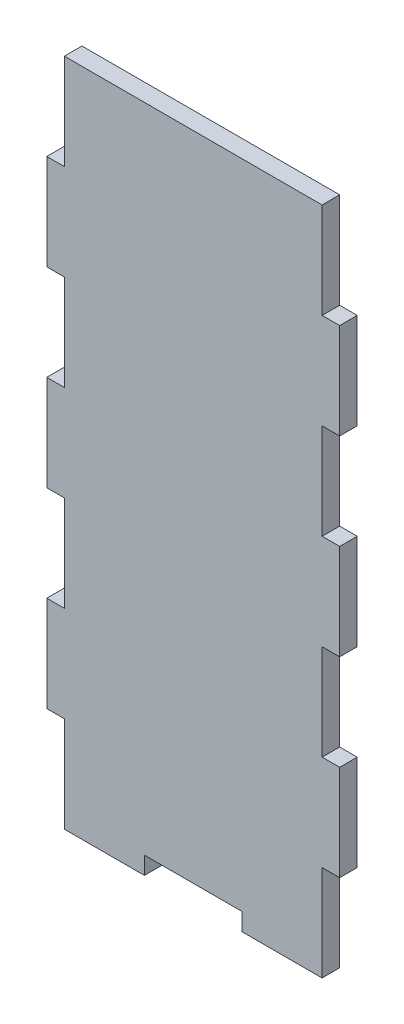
ISO-10303-21;
HEADER;
FILE_DESCRIPTION(('STEP AP214'),'2;1');
FILE_NAME('part.step','',(''),(''),'','','');
FILE_SCHEMA(('AUTOMOTIVE_DESIGN { 1 0 10303 214 1 1 1 1 }'));
ENDSEC;
DATA;
#1=APPLICATION_CONTEXT('core data for automotive mechanical design processes');
#2=APPLICATION_PROTOCOL_DEFINITION('international standard','automotive_design',2000,#1);
#3=PRODUCT_CONTEXT('',#1,'mechanical');
#4=PRODUCT('Part','Part','',(#3));
#5=PRODUCT_RELATED_PRODUCT_CATEGORY('part','',(#4));
#6=PRODUCT_DEFINITION_FORMATION('','',#4);
#7=PRODUCT_DEFINITION_CONTEXT('part definition',#1,'design');
#8=PRODUCT_DEFINITION('design','',#6,#7);
#9=PRODUCT_DEFINITION_SHAPE('','',#8);
#10=(LENGTH_UNIT() NAMED_UNIT(*) SI_UNIT(.MILLI.,.METRE.));
#11=(NAMED_UNIT(*) PLANE_ANGLE_UNIT() SI_UNIT($,.RADIAN.));
#12=(NAMED_UNIT(*) SI_UNIT($,.STERADIAN.) SOLID_ANGLE_UNIT());
#13=UNCERTAINTY_MEASURE_WITH_UNIT(LENGTH_MEASURE(1.E-05),#10,'distance_accuracy_value','');
#14=(GEOMETRIC_REPRESENTATION_CONTEXT(3) GLOBAL_UNCERTAINTY_ASSIGNED_CONTEXT((#13)) GLOBAL_UNIT_ASSIGNED_CONTEXT((#10,
#11,#12)) REPRESENTATION_CONTEXT('',''));
#15=CARTESIAN_POINT('',(0.,0.,0.));
#16=DIRECTION('',(0.,0.,1.));
#17=DIRECTION('',(1.,0.,0.));
#18=AXIS2_PLACEMENT_3D('',#15,#16,#17);
#19=CARTESIAN_POINT('',(-44.45,101.6,5.334));
#20=DIRECTION('',(0.,-1.,0.));
#21=DIRECTION('',(0.,0.,-1.));
#22=AXIS2_PLACEMENT_3D('',#19,#20,#21);
#23=PLANE('',#22);
#24=DIRECTION('',(0.,0.,1.));
#25=VECTOR('',#24,1.);
#26=CARTESIAN_POINT('',(-39.116,101.6,114.3));
#27=LINE('',#26,#25);
#28=CARTESIAN_POINT('',(-39.116,101.6,0.));
#29=VERTEX_POINT('',#28);
#30=CARTESIAN_POINT('',(-39.116,101.6,5.334));
#31=VERTEX_POINT('',#30);
#32=EDGE_CURVE('E412',#29,#31,#27,.T.);
#33=ORIENTED_EDGE('',*,*,#32,.T.);
#34=DIRECTION('',(-1.,0.,0.));
#35=VECTOR('',#34,1.);
#36=CARTESIAN_POINT('',(-44.45,101.6,5.334));
#37=LINE('',#36,#35);
#38=CARTESIAN_POINT('',(39.116,101.6,5.334));
#39=VERTEX_POINT('',#38);
#40=EDGE_CURVE('E299',#39,#31,#37,.T.);
#41=ORIENTED_EDGE('',*,*,#40,.F.);
#42=DIRECTION('',(0.,0.,-1.));
#43=VECTOR('',#42,1.);
#44=CARTESIAN_POINT('',(39.116,101.6,0.));
#45=LINE('',#44,#43);
#46=CARTESIAN_POINT('',(39.116,101.6,0.));
#47=VERTEX_POINT('',#46);
#48=EDGE_CURVE('E346',#39,#47,#45,.T.);
#49=ORIENTED_EDGE('',*,*,#48,.T.);
#50=DIRECTION('',(-1.,0.,0.));
#51=VECTOR('',#50,1.);
#52=CARTESIAN_POINT('',(-44.45,101.6,0.));
#53=LINE('',#52,#51);
#54=EDGE_CURVE('E275',#47,#29,#53,.T.);
#55=ORIENTED_EDGE('',*,*,#54,.T.);
#56=EDGE_LOOP('',(#33,#41,#49,#55));
#57=FACE_BOUND('',#56,.T.);
#58=ADVANCED_FACE('F33',(#57),#23,.F.);
#59=CARTESIAN_POINT('',(44.45,101.6,5.334));
#60=DIRECTION('',(0.,0.,-1.));
#61=DIRECTION('',(-1.,0.,0.));
#62=AXIS2_PLACEMENT_3D('',#59,#60,#61);
#63=PLANE('',#62);
#64=DIRECTION('',(1.,0.,0.));
#65=VECTOR('',#64,1.);
#66=CARTESIAN_POINT('',(-44.45,43.5428571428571,5.33399999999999));
#67=LINE('',#66,#65);
#68=CARTESIAN_POINT('',(-44.45,43.5428571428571,5.334));
#69=VERTEX_POINT('',#68);
#70=CARTESIAN_POINT('',(-39.116,43.5428571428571,5.33399999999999));
#71=VERTEX_POINT('',#70);
#72=EDGE_CURVE('E56',#69,#71,#67,.T.);
#73=ORIENTED_EDGE('',*,*,#72,.T.);
#74=DIRECTION('',(0.,1.,0.));
#75=VECTOR('',#74,1.);
#76=CARTESIAN_POINT('',(-39.116,101.6,5.334));
#77=LINE('',#76,#75);
#78=CARTESIAN_POINT('',(-39.116,14.5142857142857,5.33399999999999));
#79=VERTEX_POINT('',#78);
#80=EDGE_CURVE('E411',#79,#71,#77,.T.);
#81=ORIENTED_EDGE('',*,*,#80,.F.);
#82=DIRECTION('',(1.,0.,0.));
#83=VECTOR('',#82,1.);
#84=CARTESIAN_POINT('',(-44.45,14.5142857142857,5.33399999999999));
#85=LINE('',#84,#83);
#86=CARTESIAN_POINT('',(-44.45,14.5142857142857,5.33399999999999));
#87=VERTEX_POINT('',#86);
#88=EDGE_CURVE('E445',#87,#79,#85,.T.);
#89=ORIENTED_EDGE('',*,*,#88,.F.);
#90=DIRECTION('',(0.,-1.,0.));
#91=VECTOR('',#90,1.);
#92=CARTESIAN_POINT('',(-44.45,-101.6,5.334));
#93=LINE('',#92,#91);
#94=CARTESIAN_POINT('',(-44.45,-14.5142857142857,5.334));
#95=VERTEX_POINT('',#94);
#96=EDGE_CURVE('E298',#87,#95,#93,.T.);
#97=ORIENTED_EDGE('',*,*,#96,.T.);
#98=DIRECTION('',(1.,0.,0.));
#99=VECTOR('',#98,1.);
#100=CARTESIAN_POINT('',(-44.45,-14.5142857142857,5.33399999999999));
#101=LINE('',#100,#99);
#102=CARTESIAN_POINT('',(-39.116,-14.5142857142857,5.33399999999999));
#103=VERTEX_POINT('',#102);
#104=EDGE_CURVE('E48',#95,#103,#101,.T.);
#105=ORIENTED_EDGE('',*,*,#104,.T.);
#106=CARTESIAN_POINT('',(-39.116,-43.5428571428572,5.33399999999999));
#107=VERTEX_POINT('',#106);
#108=EDGE_CURVE('E558',#107,#103,#77,.T.);
#109=ORIENTED_EDGE('',*,*,#108,.F.);
#110=DIRECTION('',(1.,0.,0.));
#111=VECTOR('',#110,1.);
#112=CARTESIAN_POINT('',(-44.45,-43.5428571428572,5.33399999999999));
#113=LINE('',#112,#111);
#114=CARTESIAN_POINT('',(-44.45,-43.5428571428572,5.33399999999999));
#115=VERTEX_POINT('',#114);
#116=EDGE_CURVE('E426',#115,#107,#113,.T.);
#117=ORIENTED_EDGE('',*,*,#116,.F.);
#118=CARTESIAN_POINT('',(-44.45,-72.5714285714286,5.33399999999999));
#119=VERTEX_POINT('',#118);
#120=EDGE_CURVE('E295',#115,#119,#93,.T.);
#121=ORIENTED_EDGE('',*,*,#120,.T.);
#122=DIRECTION('',(1.,0.,0.));
#123=VECTOR('',#122,1.);
#124=CARTESIAN_POINT('',(-44.45,-72.5714285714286,5.33399999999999));
#125=LINE('',#124,#123);
#126=CARTESIAN_POINT('',(-39.116,-72.5714285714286,5.33399999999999));
#127=VERTEX_POINT('',#126);
#128=EDGE_CURVE('E428',#119,#127,#125,.T.);
#129=ORIENTED_EDGE('',*,*,#128,.T.);
#130=CARTESIAN_POINT('',(-39.116,-101.6,5.334));
#131=VERTEX_POINT('',#130);
#132=EDGE_CURVE('E406',#131,#127,#77,.T.);
#133=ORIENTED_EDGE('',*,*,#132,.F.);
#134=DIRECTION('',(1.,0.,0.));
#135=VECTOR('',#134,1.);
#136=CARTESIAN_POINT('',(-44.45,-101.6,5.334));
#137=LINE('',#136,#135);
#138=CARTESIAN_POINT('',(-14.8166666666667,-101.6,5.334));
#139=VERTEX_POINT('',#138);
#140=EDGE_CURVE('E41',#131,#139,#137,.T.);
#141=ORIENTED_EDGE('',*,*,#140,.T.);
#142=DIRECTION('',(0.,1.,0.));
#143=VECTOR('',#142,1.);
#144=CARTESIAN_POINT('',(-14.8166666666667,-101.6,5.334));
#145=LINE('',#144,#143);
#146=CARTESIAN_POINT('',(-14.8166666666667,-96.266,5.334));
#147=VERTEX_POINT('',#146);
#148=EDGE_CURVE('E330',#139,#147,#145,.T.);
#149=ORIENTED_EDGE('',*,*,#148,.T.);
#150=DIRECTION('',(1.,0.,0.));
#151=VECTOR('',#150,1.);
#152=CARTESIAN_POINT('',(14.8166666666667,-96.266,5.334));
#153=LINE('',#152,#151);
#154=CARTESIAN_POINT('',(14.8166666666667,-96.266,5.334));
#155=VERTEX_POINT('',#154);
#156=EDGE_CURVE('E312',#147,#155,#153,.T.);
#157=ORIENTED_EDGE('',*,*,#156,.T.);
#158=DIRECTION('',(0.,-1.,0.));
#159=VECTOR('',#158,1.);
#160=CARTESIAN_POINT('',(14.8166666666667,-101.6,5.334));
#161=LINE('',#160,#159);
#162=CARTESIAN_POINT('',(14.8166666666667,-101.6,5.334));
#163=VERTEX_POINT('',#162);
#164=EDGE_CURVE('E321',#155,#163,#161,.T.);
#165=ORIENTED_EDGE('',*,*,#164,.T.);
#166=CARTESIAN_POINT('',(39.116,-101.6,5.334));
#167=VERTEX_POINT('',#166);
#168=EDGE_CURVE('E294',#163,#167,#137,.T.);
#169=ORIENTED_EDGE('',*,*,#168,.T.);
#170=DIRECTION('',(0.,-1.,0.));
#171=VECTOR('',#170,1.);
#172=CARTESIAN_POINT('',(39.116,101.6,5.334));
#173=LINE('',#172,#171);
#174=CARTESIAN_POINT('',(39.116,-72.5714285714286,5.33399999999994));
#175=VERTEX_POINT('',#174);
#176=EDGE_CURVE('E335',#175,#167,#173,.T.);
#177=ORIENTED_EDGE('',*,*,#176,.F.);
#178=DIRECTION('',(-1.,0.,0.));
#179=VECTOR('',#178,1.);
#180=CARTESIAN_POINT('',(44.45,-72.5714285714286,5.33399999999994));
#181=LINE('',#180,#179);
#182=CARTESIAN_POINT('',(44.45,-72.5714285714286,5.33399999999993));
#183=VERTEX_POINT('',#182);
#184=EDGE_CURVE('E352',#183,#175,#181,.T.);
#185=ORIENTED_EDGE('',*,*,#184,.F.);
#186=DIRECTION('',(0.,1.,0.));
#187=VECTOR('',#186,1.);
#188=CARTESIAN_POINT('',(44.45,-101.6,5.334));
#189=LINE('',#188,#187);
#190=CARTESIAN_POINT('',(44.45,-43.5428571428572,5.33399999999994));
#191=VERTEX_POINT('',#190);
#192=EDGE_CURVE('E303',#183,#191,#189,.T.);
#193=ORIENTED_EDGE('',*,*,#192,.T.);
#194=DIRECTION('',(-1.,0.,0.));
#195=VECTOR('',#194,1.);
#196=CARTESIAN_POINT('',(44.45,-43.5428571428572,5.33399999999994));
#197=LINE('',#196,#195);
#198=CARTESIAN_POINT('',(39.116,-43.5428571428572,5.33399999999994));
#199=VERTEX_POINT('',#198);
#200=EDGE_CURVE('E355',#191,#199,#197,.T.);
#201=ORIENTED_EDGE('',*,*,#200,.T.);
#202=CARTESIAN_POINT('',(39.116,-14.5142857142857,5.33399999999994));
#203=VERTEX_POINT('',#202);
#204=EDGE_CURVE('E337',#203,#199,#173,.T.);
#205=ORIENTED_EDGE('',*,*,#204,.F.);
#206=DIRECTION('',(-1.,0.,0.));
#207=VECTOR('',#206,1.);
#208=CARTESIAN_POINT('',(44.45,-14.5142857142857,5.33399999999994));
#209=LINE('',#208,#207);
#210=CARTESIAN_POINT('',(44.45,-14.5142857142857,5.33399999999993));
#211=VERTEX_POINT('',#210);
#212=EDGE_CURVE('E372',#211,#203,#209,.T.);
#213=ORIENTED_EDGE('',*,*,#212,.F.);
#214=CARTESIAN_POINT('',(44.45,14.5142857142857,5.33399999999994));
#215=VERTEX_POINT('',#214);
#216=EDGE_CURVE('E307',#211,#215,#189,.T.);
#217=ORIENTED_EDGE('',*,*,#216,.T.);
#218=DIRECTION('',(-1.,0.,0.));
#219=VECTOR('',#218,1.);
#220=CARTESIAN_POINT('',(44.45,14.5142857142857,5.33399999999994));
#221=LINE('',#220,#219);
#222=CARTESIAN_POINT('',(39.116,14.5142857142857,5.33399999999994));
#223=VERTEX_POINT('',#222);
#224=EDGE_CURVE('E375',#215,#223,#221,.T.);
#225=ORIENTED_EDGE('',*,*,#224,.T.);
#226=CARTESIAN_POINT('',(39.116,43.5428571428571,5.33399999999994));
#227=VERTEX_POINT('',#226);
#228=EDGE_CURVE('E493',#227,#223,#173,.T.);
#229=ORIENTED_EDGE('',*,*,#228,.F.);
#230=DIRECTION('',(-1.,0.,0.));
#231=VECTOR('',#230,1.);
#232=CARTESIAN_POINT('',(44.45,43.5428571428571,5.33399999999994));
#233=LINE('',#232,#231);
#234=CARTESIAN_POINT('',(44.45,43.5428571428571,5.33399999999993));
#235=VERTEX_POINT('',#234);
#236=EDGE_CURVE('E392',#235,#227,#233,.T.);
#237=ORIENTED_EDGE('',*,*,#236,.F.);
#238=CARTESIAN_POINT('',(44.45,72.5714285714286,5.33399999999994));
#239=VERTEX_POINT('',#238);
#240=EDGE_CURVE('E304',#235,#239,#189,.T.);
#241=ORIENTED_EDGE('',*,*,#240,.T.);
#242=DIRECTION('',(-1.,0.,0.));
#243=VECTOR('',#242,1.);
#244=CARTESIAN_POINT('',(44.45,72.5714285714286,5.33399999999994));
#245=LINE('',#244,#243);
#246=CARTESIAN_POINT('',(39.116,72.5714285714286,5.33399999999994));
#247=VERTEX_POINT('',#246);
#248=EDGE_CURVE('E395',#239,#247,#245,.T.);
#249=ORIENTED_EDGE('',*,*,#248,.T.);
#250=EDGE_CURVE('E327',#39,#247,#173,.T.);
#251=ORIENTED_EDGE('',*,*,#250,.F.);
#252=ORIENTED_EDGE('',*,*,#40,.T.);
#253=CARTESIAN_POINT('',(-39.116,72.5714285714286,5.33399999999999));
#254=VERTEX_POINT('',#253);
#255=EDGE_CURVE('E409',#254,#31,#77,.T.);
#256=ORIENTED_EDGE('',*,*,#255,.F.);
#257=DIRECTION('',(1.,0.,0.));
#258=VECTOR('',#257,1.);
#259=CARTESIAN_POINT('',(-44.45,72.5714285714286,5.33399999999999));
#260=LINE('',#259,#258);
#261=CARTESIAN_POINT('',(-44.45,72.5714285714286,5.33399999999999));
#262=VERTEX_POINT('',#261);
#263=EDGE_CURVE('E457',#262,#254,#260,.T.);
#264=ORIENTED_EDGE('',*,*,#263,.F.);
#265=EDGE_CURVE('E300',#262,#69,#93,.T.);
#266=ORIENTED_EDGE('',*,*,#265,.T.);
#267=EDGE_LOOP('',(#73,#81,#89,#97,#105,#109,#117,#121,#129,#133,#141,#149,#157,#165,#169,#177,
#185,#193,#201,#205,#213,#217,#225,#229,#237,#241,#249,#251,#252,#256,#264,#266));
#268=FACE_BOUND('',#267,.T.);
#269=ADVANCED_FACE('F469',(#268),#63,.F.);
#270=CARTESIAN_POINT('',(44.45,101.6,0.));
#271=DIRECTION('',(0.,0.,-1.));
#272=DIRECTION('',(-1.,0.,0.));
#273=AXIS2_PLACEMENT_3D('',#270,#271,#272);
#274=PLANE('',#273);
#275=DIRECTION('',(1.,0.,0.));
#276=VECTOR('',#275,1.);
#277=CARTESIAN_POINT('',(-44.45,-101.6,0.));
#278=LINE('',#277,#276);
#279=CARTESIAN_POINT('',(-39.116,-101.6,0.));
#280=VERTEX_POINT('',#279);
#281=CARTESIAN_POINT('',(-14.8166666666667,-101.6,0.));
#282=VERTEX_POINT('',#281);
#283=EDGE_CURVE('E271',#280,#282,#278,.T.);
#284=ORIENTED_EDGE('',*,*,#283,.F.);
#285=DIRECTION('',(0.,1.,0.));
#286=VECTOR('',#285,1.);
#287=CARTESIAN_POINT('',(-39.116,-101.6,0.));
#288=LINE('',#287,#286);
#289=CARTESIAN_POINT('',(-39.116,-72.5714285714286,0.));
#290=VERTEX_POINT('',#289);
#291=EDGE_CURVE('E414',#280,#290,#288,.T.);
#292=ORIENTED_EDGE('',*,*,#291,.T.);
#293=DIRECTION('',(1.,0.,0.));
#294=VECTOR('',#293,1.);
#295=CARTESIAN_POINT('',(-44.45,-72.5714285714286,0.));
#296=LINE('',#295,#294);
#297=CARTESIAN_POINT('',(-44.45,-72.5714285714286,0.));
#298=VERTEX_POINT('',#297);
#299=EDGE_CURVE('E419',#298,#290,#296,.T.);
#300=ORIENTED_EDGE('',*,*,#299,.F.);
#301=DIRECTION('',(0.,-1.,0.));
#302=VECTOR('',#301,1.);
#303=CARTESIAN_POINT('',(-44.45,-101.6,0.));
#304=LINE('',#303,#302);
#305=CARTESIAN_POINT('',(-44.45,-43.5428571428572,0.));
#306=VERTEX_POINT('',#305);
#307=EDGE_CURVE('E269',#306,#298,#304,.T.);
#308=ORIENTED_EDGE('',*,*,#307,.F.);
#309=DIRECTION('',(1.,0.,0.));
#310=VECTOR('',#309,1.);
#311=CARTESIAN_POINT('',(-44.45,-43.5428571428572,0.));
#312=LINE('',#311,#310);
#313=CARTESIAN_POINT('',(-39.116,-43.5428571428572,0.));
#314=VERTEX_POINT('',#313);
#315=EDGE_CURVE('E422',#306,#314,#312,.T.);
#316=ORIENTED_EDGE('',*,*,#315,.T.);
#317=CARTESIAN_POINT('',(-39.116,-14.5142857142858,0.));
#318=VERTEX_POINT('',#317);
#319=EDGE_CURVE('E417',#314,#318,#288,.T.);
#320=ORIENTED_EDGE('',*,*,#319,.T.);
#321=DIRECTION('',(1.,0.,0.));
#322=VECTOR('',#321,1.);
#323=CARTESIAN_POINT('',(-44.45,-14.5142857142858,0.));
#324=LINE('',#323,#322);
#325=CARTESIAN_POINT('',(-44.45,-14.5142857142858,0.));
#326=VERTEX_POINT('',#325);
#327=EDGE_CURVE('E439',#326,#318,#324,.T.);
#328=ORIENTED_EDGE('',*,*,#327,.F.);
#329=CARTESIAN_POINT('',(-44.45,14.5142857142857,0.));
#330=VERTEX_POINT('',#329);
#331=EDGE_CURVE('E267',#330,#326,#304,.T.);
#332=ORIENTED_EDGE('',*,*,#331,.F.);
#333=DIRECTION('',(1.,0.,0.));
#334=VECTOR('',#333,1.);
#335=CARTESIAN_POINT('',(-44.45,14.5142857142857,0.));
#336=LINE('',#335,#334);
#337=CARTESIAN_POINT('',(-39.116,14.5142857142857,0.));
#338=VERTEX_POINT('',#337);
#339=EDGE_CURVE('E442',#330,#338,#336,.T.);
#340=ORIENTED_EDGE('',*,*,#339,.T.);
#341=CARTESIAN_POINT('',(-39.116,43.5428571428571,0.));
#342=VERTEX_POINT('',#341);
#343=EDGE_CURVE('E261',#338,#342,#288,.T.);
#344=ORIENTED_EDGE('',*,*,#343,.T.);
#345=DIRECTION('',(1.,0.,0.));
#346=VECTOR('',#345,1.);
#347=CARTESIAN_POINT('',(-44.45,43.5428571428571,0.));
#348=LINE('',#347,#346);
#349=CARTESIAN_POINT('',(-44.45,43.5428571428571,0.));
#350=VERTEX_POINT('',#349);
#351=EDGE_CURVE('E244',#350,#342,#348,.T.);
#352=ORIENTED_EDGE('',*,*,#351,.F.);
#353=CARTESIAN_POINT('',(-44.45,72.5714285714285,0.));
#354=VERTEX_POINT('',#353);
#355=EDGE_CURVE('E258',#354,#350,#304,.T.);
#356=ORIENTED_EDGE('',*,*,#355,.F.);
#357=DIRECTION('',(1.,0.,0.));
#358=VECTOR('',#357,1.);
#359=CARTESIAN_POINT('',(-44.45,72.5714285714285,0.));
#360=LINE('',#359,#358);
#361=CARTESIAN_POINT('',(-39.116,72.5714285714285,0.));
#362=VERTEX_POINT('',#361);
#363=EDGE_CURVE('E262',#354,#362,#360,.T.);
#364=ORIENTED_EDGE('',*,*,#363,.T.);
#365=EDGE_CURVE('E418',#362,#29,#288,.T.);
#366=ORIENTED_EDGE('',*,*,#365,.T.);
#367=ORIENTED_EDGE('',*,*,#54,.F.);
#368=DIRECTION('',(0.,-1.,0.));
#369=VECTOR('',#368,1.);
#370=CARTESIAN_POINT('',(39.116,-101.6,0.));
#371=LINE('',#370,#369);
#372=CARTESIAN_POINT('',(39.116,72.5714285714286,0.));
#373=VERTEX_POINT('',#372);
#374=EDGE_CURVE('E341',#47,#373,#371,.T.);
#375=ORIENTED_EDGE('',*,*,#374,.T.);
#376=DIRECTION('',(-1.,0.,0.));
#377=VECTOR('',#376,1.);
#378=CARTESIAN_POINT('',(44.45,72.5714285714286,0.));
#379=LINE('',#378,#377);
#380=CARTESIAN_POINT('',(44.45,72.5714285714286,0.));
#381=VERTEX_POINT('',#380);
#382=EDGE_CURVE('E386',#381,#373,#379,.T.);
#383=ORIENTED_EDGE('',*,*,#382,.F.);
#384=DIRECTION('',(0.,1.,0.));
#385=VECTOR('',#384,1.);
#386=CARTESIAN_POINT('',(44.45,-101.6,0.));
#387=LINE('',#386,#385);
#388=CARTESIAN_POINT('',(44.45,43.5428571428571,0.));
#389=VERTEX_POINT('',#388);
#390=EDGE_CURVE('E289',#389,#381,#387,.T.);
#391=ORIENTED_EDGE('',*,*,#390,.F.);
#392=DIRECTION('',(-1.,0.,0.));
#393=VECTOR('',#392,1.);
#394=CARTESIAN_POINT('',(44.45,43.5428571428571,0.));
#395=LINE('',#394,#393);
#396=CARTESIAN_POINT('',(39.116,43.5428571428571,0.));
#397=VERTEX_POINT('',#396);
#398=EDGE_CURVE('E389',#389,#397,#395,.T.);
#399=ORIENTED_EDGE('',*,*,#398,.T.);
#400=CARTESIAN_POINT('',(39.116,14.5142857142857,0.));
#401=VERTEX_POINT('',#400);
#402=EDGE_CURVE('E344',#397,#401,#371,.T.);
#403=ORIENTED_EDGE('',*,*,#402,.T.);
#404=DIRECTION('',(-1.,0.,0.));
#405=VECTOR('',#404,1.);
#406=CARTESIAN_POINT('',(44.45,14.5142857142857,0.));
#407=LINE('',#406,#405);
#408=CARTESIAN_POINT('',(44.45,14.5142857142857,0.));
#409=VERTEX_POINT('',#408);
#410=EDGE_CURVE('E366',#409,#401,#407,.T.);
#411=ORIENTED_EDGE('',*,*,#410,.F.);
#412=CARTESIAN_POINT('',(44.45,-14.5142857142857,0.));
#413=VERTEX_POINT('',#412);
#414=EDGE_CURVE('E287',#413,#409,#387,.T.);
#415=ORIENTED_EDGE('',*,*,#414,.F.);
#416=DIRECTION('',(-1.,0.,0.));
#417=VECTOR('',#416,1.);
#418=CARTESIAN_POINT('',(44.45,-14.5142857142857,0.));
#419=LINE('',#418,#417);
#420=CARTESIAN_POINT('',(39.116,-14.5142857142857,0.));
#421=VERTEX_POINT('',#420);
#422=EDGE_CURVE('E369',#413,#421,#419,.T.);
#423=ORIENTED_EDGE('',*,*,#422,.T.);
#424=CARTESIAN_POINT('',(39.116,-43.5428571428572,0.));
#425=VERTEX_POINT('',#424);
#426=EDGE_CURVE('E528',#421,#425,#371,.T.);
#427=ORIENTED_EDGE('',*,*,#426,.T.);
#428=DIRECTION('',(-1.,0.,0.));
#429=VECTOR('',#428,1.);
#430=CARTESIAN_POINT('',(44.45,-43.5428571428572,0.));
#431=LINE('',#430,#429);
#432=CARTESIAN_POINT('',(44.45,-43.5428571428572,0.));
#433=VERTEX_POINT('',#432);
#434=EDGE_CURVE('E348',#433,#425,#431,.T.);
#435=ORIENTED_EDGE('',*,*,#434,.F.);
#436=CARTESIAN_POINT('',(44.45,-72.5714285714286,0.));
#437=VERTEX_POINT('',#436);
#438=EDGE_CURVE('E281',#437,#433,#387,.T.);
#439=ORIENTED_EDGE('',*,*,#438,.F.);
#440=DIRECTION('',(-1.,0.,0.));
#441=VECTOR('',#440,1.);
#442=CARTESIAN_POINT('',(44.45,-72.5714285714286,0.));
#443=LINE('',#442,#441);
#444=CARTESIAN_POINT('',(39.116,-72.5714285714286,0.));
#445=VERTEX_POINT('',#444);
#446=EDGE_CURVE('E349',#437,#445,#443,.T.);
#447=ORIENTED_EDGE('',*,*,#446,.T.);
#448=CARTESIAN_POINT('',(39.116,-101.6,0.));
#449=VERTEX_POINT('',#448);
#450=EDGE_CURVE('E345',#445,#449,#371,.T.);
#451=ORIENTED_EDGE('',*,*,#450,.T.);
#452=CARTESIAN_POINT('',(14.8166666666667,-101.6,0.));
#453=VERTEX_POINT('',#452);
#454=EDGE_CURVE('E266',#453,#449,#278,.T.);
#455=ORIENTED_EDGE('',*,*,#454,.F.);
#456=DIRECTION('',(0.,-1.,0.));
#457=VECTOR('',#456,1.);
#458=CARTESIAN_POINT('',(14.8166666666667,-101.6,0.));
#459=LINE('',#458,#457);
#460=CARTESIAN_POINT('',(14.8166666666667,-96.266,0.));
#461=VERTEX_POINT('',#460);
#462=EDGE_CURVE('E325',#461,#453,#459,.T.);
#463=ORIENTED_EDGE('',*,*,#462,.F.);
#464=DIRECTION('',(1.,0.,0.));
#465=VECTOR('',#464,1.);
#466=CARTESIAN_POINT('',(14.8166666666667,-96.266,0.));
#467=LINE('',#466,#465);
#468=CARTESIAN_POINT('',(-14.8166666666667,-96.266,0.));
#469=VERTEX_POINT('',#468);
#470=EDGE_CURVE('E318',#469,#461,#467,.T.);
#471=ORIENTED_EDGE('',*,*,#470,.F.);
#472=DIRECTION('',(0.,1.,0.));
#473=VECTOR('',#472,1.);
#474=CARTESIAN_POINT('',(-14.8166666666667,-101.6,0.));
#475=LINE('',#474,#473);
#476=EDGE_CURVE('E322',#282,#469,#475,.T.);
#477=ORIENTED_EDGE('',*,*,#476,.F.);
#478=EDGE_LOOP('',(#284,#292,#300,#308,#316,#320,#328,#332,#340,#344,#352,#356,#364,#366,#367,
#375,#383,#391,#399,#403,#411,#415,#423,#427,#435,#439,#447,#451,#455,#463,#471,#477));
#479=FACE_BOUND('',#478,.T.);
#480=ADVANCED_FACE('F256',(#479),#274,.T.);
#481=CARTESIAN_POINT('',(-44.45,-101.6,5.334));
#482=DIRECTION('',(1.,0.,0.));
#483=DIRECTION('',(0.,0.,-1.));
#484=AXIS2_PLACEMENT_3D('',#481,#482,#483);
#485=PLANE('',#484);
#486=DIRECTION('',(0.,0.,-1.));
#487=VECTOR('',#486,1.);
#488=CARTESIAN_POINT('',(-44.45,-72.5714285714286,0.));
#489=LINE('',#488,#487);
#490=EDGE_CURVE('E434',#119,#298,#489,.T.);
#491=ORIENTED_EDGE('',*,*,#490,.F.);
#492=ORIENTED_EDGE('',*,*,#120,.F.);
#493=DIRECTION('',(0.,0.,1.));
#494=VECTOR('',#493,1.);
#495=CARTESIAN_POINT('',(-44.45,-43.5428571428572,0.));
#496=LINE('',#495,#494);
#497=EDGE_CURVE('E423',#306,#115,#496,.T.);
#498=ORIENTED_EDGE('',*,*,#497,.F.);
#499=ORIENTED_EDGE('',*,*,#307,.T.);
#500=EDGE_LOOP('',(#491,#492,#498,#499));
#501=FACE_BOUND('',#500,.T.);
#502=ADVANCED_FACE('F580',(#501),#485,.F.);
#503=DIRECTION('',(0.,0.,-1.));
#504=VECTOR('',#503,1.);
#505=CARTESIAN_POINT('',(-44.45,-14.5142857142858,0.));
#506=LINE('',#505,#504);
#507=EDGE_CURVE('E451',#95,#326,#506,.T.);
#508=ORIENTED_EDGE('',*,*,#507,.F.);
#509=ORIENTED_EDGE('',*,*,#96,.F.);
#510=DIRECTION('',(0.,0.,1.));
#511=VECTOR('',#510,1.);
#512=CARTESIAN_POINT('',(-44.45,14.5142857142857,0.));
#513=LINE('',#512,#511);
#514=EDGE_CURVE('E443',#330,#87,#513,.T.);
#515=ORIENTED_EDGE('',*,*,#514,.F.);
#516=ORIENTED_EDGE('',*,*,#331,.T.);
#517=EDGE_LOOP('',(#508,#509,#515,#516));
#518=FACE_BOUND('',#517,.T.);
#519=ADVANCED_FACE('F478',(#518),#485,.F.);
#520=DIRECTION('',(0.,0.,-1.));
#521=VECTOR('',#520,1.);
#522=CARTESIAN_POINT('',(-44.45,43.5428571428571,0.));
#523=LINE('',#522,#521);
#524=EDGE_CURVE('E241',#69,#350,#523,.T.);
#525=ORIENTED_EDGE('',*,*,#524,.F.);
#526=ORIENTED_EDGE('',*,*,#265,.F.);
#527=DIRECTION('',(0.,0.,1.));
#528=VECTOR('',#527,1.);
#529=CARTESIAN_POINT('',(-44.45,72.5714285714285,0.));
#530=LINE('',#529,#528);
#531=EDGE_CURVE('E250',#354,#262,#530,.T.);
#532=ORIENTED_EDGE('',*,*,#531,.F.);
#533=ORIENTED_EDGE('',*,*,#355,.T.);
#534=EDGE_LOOP('',(#525,#526,#532,#533));
#535=FACE_BOUND('',#534,.T.);
#536=ADVANCED_FACE('F265',(#535),#485,.F.);
#537=CARTESIAN_POINT('',(-44.45,-101.6,5.334));
#538=DIRECTION('',(0.,1.,0.));
#539=DIRECTION('',(0.,0.,1.));
#540=AXIS2_PLACEMENT_3D('',#537,#538,#539);
#541=PLANE('',#540);
#542=DIRECTION('',(0.,0.,1.));
#543=VECTOR('',#542,1.);
#544=CARTESIAN_POINT('',(-39.116,-101.6,5.334));
#545=LINE('',#544,#543);
#546=EDGE_CURVE('E11',#280,#131,#545,.T.);
#547=ORIENTED_EDGE('',*,*,#546,.F.);
#548=ORIENTED_EDGE('',*,*,#283,.T.);
#549=DIRECTION('',(0.,0.,-1.));
#550=VECTOR('',#549,1.);
#551=CARTESIAN_POINT('',(-14.8166666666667,-101.6,5.334));
#552=LINE('',#551,#550);
#553=EDGE_CURVE('E311',#139,#282,#552,.T.);
#554=ORIENTED_EDGE('',*,*,#553,.F.);
#555=ORIENTED_EDGE('',*,*,#140,.F.);
#556=EDGE_LOOP('',(#547,#548,#554,#555));
#557=FACE_BOUND('',#556,.T.);
#558=ADVANCED_FACE('F553',(#557),#541,.F.);
#559=DIRECTION('',(0.,0.,1.));
#560=VECTOR('',#559,1.);
#561=CARTESIAN_POINT('',(39.116,-101.6,0.));
#562=LINE('',#561,#560);
#563=EDGE_CURVE('E338',#449,#167,#562,.T.);
#564=ORIENTED_EDGE('',*,*,#563,.T.);
#565=ORIENTED_EDGE('',*,*,#168,.F.);
#566=DIRECTION('',(0.,0.,-1.));
#567=VECTOR('',#566,1.);
#568=CARTESIAN_POINT('',(14.8166666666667,-101.6,5.334));
#569=LINE('',#568,#567);
#570=EDGE_CURVE('E308',#163,#453,#569,.T.);
#571=ORIENTED_EDGE('',*,*,#570,.T.);
#572=ORIENTED_EDGE('',*,*,#454,.T.);
#573=EDGE_LOOP('',(#564,#565,#571,#572));
#574=FACE_BOUND('',#573,.T.);
#575=ADVANCED_FACE('F536',(#574),#541,.F.);
#576=CARTESIAN_POINT('',(44.45,-101.6,5.334));
#577=DIRECTION('',(-1.,0.,0.));
#578=DIRECTION('',(0.,0.,1.));
#579=AXIS2_PLACEMENT_3D('',#576,#577,#578);
#580=PLANE('',#579);
#581=DIRECTION('',(0.,0.,-1.));
#582=VECTOR('',#581,1.);
#583=CARTESIAN_POINT('',(44.45,-43.5428571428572,0.));
#584=LINE('',#583,#582);
#585=EDGE_CURVE('E353',#191,#433,#584,.T.);
#586=ORIENTED_EDGE('',*,*,#585,.F.);
#587=ORIENTED_EDGE('',*,*,#192,.F.);
#588=DIRECTION('',(0.,0.,1.));
#589=VECTOR('',#588,1.);
#590=CARTESIAN_POINT('',(44.45,-72.5714285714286,0.));
#591=LINE('',#590,#589);
#592=EDGE_CURVE('E362',#437,#183,#591,.T.);
#593=ORIENTED_EDGE('',*,*,#592,.F.);
#594=ORIENTED_EDGE('',*,*,#438,.T.);
#595=EDGE_LOOP('',(#586,#587,#593,#594));
#596=FACE_BOUND('',#595,.T.);
#597=ADVANCED_FACE('F35',(#596),#580,.F.);
#598=DIRECTION('',(0.,0.,-1.));
#599=VECTOR('',#598,1.);
#600=CARTESIAN_POINT('',(44.45,14.5142857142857,0.));
#601=LINE('',#600,#599);
#602=EDGE_CURVE('E373',#215,#409,#601,.T.);
#603=ORIENTED_EDGE('',*,*,#602,.F.);
#604=ORIENTED_EDGE('',*,*,#216,.F.);
#605=DIRECTION('',(0.,0.,1.));
#606=VECTOR('',#605,1.);
#607=CARTESIAN_POINT('',(44.45,-14.5142857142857,0.));
#608=LINE('',#607,#606);
#609=EDGE_CURVE('E382',#413,#211,#608,.T.);
#610=ORIENTED_EDGE('',*,*,#609,.F.);
#611=ORIENTED_EDGE('',*,*,#414,.T.);
#612=EDGE_LOOP('',(#603,#604,#610,#611));
#613=FACE_BOUND('',#612,.T.);
#614=ADVANCED_FACE('F519',(#613),#580,.F.);
#615=DIRECTION('',(0.,0.,-1.));
#616=VECTOR('',#615,1.);
#617=CARTESIAN_POINT('',(44.45,72.5714285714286,0.));
#618=LINE('',#617,#616);
#619=EDGE_CURVE('E393',#239,#381,#618,.T.);
#620=ORIENTED_EDGE('',*,*,#619,.F.);
#621=ORIENTED_EDGE('',*,*,#240,.F.);
#622=DIRECTION('',(0.,0.,1.));
#623=VECTOR('',#622,1.);
#624=CARTESIAN_POINT('',(44.45,43.5428571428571,0.));
#625=LINE('',#624,#623);
#626=EDGE_CURVE('E402',#389,#235,#625,.T.);
#627=ORIENTED_EDGE('',*,*,#626,.F.);
#628=ORIENTED_EDGE('',*,*,#390,.T.);
#629=EDGE_LOOP('',(#620,#621,#627,#628));
#630=FACE_BOUND('',#629,.T.);
#631=ADVANCED_FACE('F589',(#630),#580,.F.);
#632=CARTESIAN_POINT('',(14.8166666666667,-101.6,5.334));
#633=DIRECTION('',(1.,0.,0.));
#634=DIRECTION('',(0.,0.,-1.));
#635=AXIS2_PLACEMENT_3D('',#632,#633,#634);
#636=PLANE('',#635);
#637=ORIENTED_EDGE('',*,*,#462,.T.);
#638=ORIENTED_EDGE('',*,*,#570,.F.);
#639=ORIENTED_EDGE('',*,*,#164,.F.);
#640=DIRECTION('',(0.,0.,-1.));
#641=VECTOR('',#640,1.);
#642=CARTESIAN_POINT('',(14.8166666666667,-96.266,5.334));
#643=LINE('',#642,#641);
#644=EDGE_CURVE('E292',#155,#461,#643,.T.);
#645=ORIENTED_EDGE('',*,*,#644,.T.);
#646=EDGE_LOOP('',(#637,#638,#639,#645));
#647=FACE_BOUND('',#646,.T.);
#648=ADVANCED_FACE('F540',(#647),#636,.F.);
#649=CARTESIAN_POINT('',(14.8166666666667,-96.266,5.334));
#650=DIRECTION('',(0.,1.,0.));
#651=DIRECTION('',(-1.,0.,0.));
#652=AXIS2_PLACEMENT_3D('',#649,#650,#651);
#653=PLANE('',#652);
#654=ORIENTED_EDGE('',*,*,#470,.T.);
#655=ORIENTED_EDGE('',*,*,#644,.F.);
#656=ORIENTED_EDGE('',*,*,#156,.F.);
#657=DIRECTION('',(0.,0.,-1.));
#658=VECTOR('',#657,1.);
#659=CARTESIAN_POINT('',(-14.8166666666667,-96.266,5.334));
#660=LINE('',#659,#658);
#661=EDGE_CURVE('E315',#147,#469,#660,.T.);
#662=ORIENTED_EDGE('',*,*,#661,.T.);
#663=EDGE_LOOP('',(#654,#655,#656,#662));
#664=FACE_BOUND('',#663,.T.);
#665=ADVANCED_FACE('F544',(#664),#653,.F.);
#666=CARTESIAN_POINT('',(-14.8166666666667,-101.6,5.334));
#667=DIRECTION('',(-1.,0.,0.));
#668=DIRECTION('',(0.,0.,1.));
#669=AXIS2_PLACEMENT_3D('',#666,#667,#668);
#670=PLANE('',#669);
#671=ORIENTED_EDGE('',*,*,#476,.T.);
#672=ORIENTED_EDGE('',*,*,#661,.F.);
#673=ORIENTED_EDGE('',*,*,#148,.F.);
#674=ORIENTED_EDGE('',*,*,#553,.T.);
#675=EDGE_LOOP('',(#671,#672,#673,#674));
#676=FACE_BOUND('',#675,.T.);
#677=ADVANCED_FACE('F548',(#676),#670,.F.);
#678=CARTESIAN_POINT('',(44.45,14.5142857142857,0.));
#679=DIRECTION('',(0.,1.,0.));
#680=DIRECTION('',(0.,0.,-1.));
#681=AXIS2_PLACEMENT_3D('',#678,#679,#680);
#682=PLANE('',#681);
#683=DIRECTION('',(0.,0.,-1.));
#684=VECTOR('',#683,1.);
#685=CARTESIAN_POINT('',(39.116,14.5142857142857,0.));
#686=LINE('',#685,#684);
#687=EDGE_CURVE('E380',#223,#401,#686,.T.);
#688=ORIENTED_EDGE('',*,*,#687,.F.);
#689=ORIENTED_EDGE('',*,*,#224,.F.);
#690=ORIENTED_EDGE('',*,*,#602,.T.);
#691=ORIENTED_EDGE('',*,*,#410,.T.);
#692=EDGE_LOOP('',(#688,#689,#690,#691));
#693=FACE_BOUND('',#692,.T.);
#694=ADVANCED_FACE('F524',(#693),#682,.T.);
#695=CARTESIAN_POINT('',(44.45,43.5428571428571,0.));
#696=DIRECTION('',(0.,-1.,0.));
#697=DIRECTION('',(0.,0.,1.));
#698=AXIS2_PLACEMENT_3D('',#695,#696,#697);
#699=PLANE('',#698);
#700=DIRECTION('',(0.,0.,1.));
#701=VECTOR('',#700,1.);
#702=CARTESIAN_POINT('',(39.116,43.5428571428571,0.));
#703=LINE('',#702,#701);
#704=EDGE_CURVE('E403',#397,#227,#703,.T.);
#705=ORIENTED_EDGE('',*,*,#704,.F.);
#706=ORIENTED_EDGE('',*,*,#398,.F.);
#707=ORIENTED_EDGE('',*,*,#626,.T.);
#708=ORIENTED_EDGE('',*,*,#236,.T.);
#709=EDGE_LOOP('',(#705,#706,#707,#708));
#710=FACE_BOUND('',#709,.T.);
#711=ADVANCED_FACE('F612',(#710),#699,.T.);
#712=CARTESIAN_POINT('',(39.116,101.6,114.3));
#713=DIRECTION('',(1.,0.,0.));
#714=DIRECTION('',(0.,0.,-1.));
#715=AXIS2_PLACEMENT_3D('',#712,#713,#714);
#716=PLANE('',#715);
#717=ORIENTED_EDGE('',*,*,#228,.T.);
#718=ORIENTED_EDGE('',*,*,#687,.T.);
#719=ORIENTED_EDGE('',*,*,#402,.F.);
#720=ORIENTED_EDGE('',*,*,#704,.T.);
#721=EDGE_LOOP('',(#717,#718,#719,#720));
#722=FACE_BOUND('',#721,.T.);
#723=ADVANCED_FACE('F598',(#722),#716,.T.);
#724=CARTESIAN_POINT('',(44.45,72.5714285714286,0.));
#725=DIRECTION('',(0.,1.,0.));
#726=DIRECTION('',(0.,0.,-1.));
#727=AXIS2_PLACEMENT_3D('',#724,#725,#726);
#728=PLANE('',#727);
#729=DIRECTION('',(0.,0.,-1.));
#730=VECTOR('',#729,1.);
#731=CARTESIAN_POINT('',(39.116,72.5714285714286,0.));
#732=LINE('',#731,#730);
#733=EDGE_CURVE('E400',#247,#373,#732,.T.);
#734=ORIENTED_EDGE('',*,*,#733,.F.);
#735=ORIENTED_EDGE('',*,*,#248,.F.);
#736=ORIENTED_EDGE('',*,*,#619,.T.);
#737=ORIENTED_EDGE('',*,*,#382,.T.);
#738=EDGE_LOOP('',(#734,#735,#736,#737));
#739=FACE_BOUND('',#738,.T.);
#740=ADVANCED_FACE('F597',(#739),#728,.T.);
#741=ORIENTED_EDGE('',*,*,#250,.T.);
#742=ORIENTED_EDGE('',*,*,#733,.T.);
#743=ORIENTED_EDGE('',*,*,#374,.F.);
#744=ORIENTED_EDGE('',*,*,#48,.F.);
#745=EDGE_LOOP('',(#741,#742,#743,#744));
#746=FACE_BOUND('',#745,.T.);
#747=ADVANCED_FACE('F594',(#746),#716,.T.);
#748=CARTESIAN_POINT('',(44.45,-43.5428571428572,0.));
#749=DIRECTION('',(0.,1.,0.));
#750=DIRECTION('',(0.,0.,-1.));
#751=AXIS2_PLACEMENT_3D('',#748,#749,#750);
#752=PLANE('',#751);
#753=DIRECTION('',(0.,0.,-1.));
#754=VECTOR('',#753,1.);
#755=CARTESIAN_POINT('',(39.116,-43.5428571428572,0.));
#756=LINE('',#755,#754);
#757=EDGE_CURVE('E360',#199,#425,#756,.T.);
#758=ORIENTED_EDGE('',*,*,#757,.F.);
#759=ORIENTED_EDGE('',*,*,#200,.F.);
#760=ORIENTED_EDGE('',*,*,#585,.T.);
#761=ORIENTED_EDGE('',*,*,#434,.T.);
#762=EDGE_LOOP('',(#758,#759,#760,#761));
#763=FACE_BOUND('',#762,.T.);
#764=ADVANCED_FACE('F504',(#763),#752,.T.);
#765=CARTESIAN_POINT('',(44.45,-14.5142857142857,0.));
#766=DIRECTION('',(0.,-1.,0.));
#767=DIRECTION('',(0.,0.,1.));
#768=AXIS2_PLACEMENT_3D('',#765,#766,#767);
#769=PLANE('',#768);
#770=DIRECTION('',(0.,0.,1.));
#771=VECTOR('',#770,1.);
#772=CARTESIAN_POINT('',(39.116,-14.5142857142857,0.));
#773=LINE('',#772,#771);
#774=EDGE_CURVE('E383',#421,#203,#773,.T.);
#775=ORIENTED_EDGE('',*,*,#774,.F.);
#776=ORIENTED_EDGE('',*,*,#422,.F.);
#777=ORIENTED_EDGE('',*,*,#609,.T.);
#778=ORIENTED_EDGE('',*,*,#212,.T.);
#779=EDGE_LOOP('',(#775,#776,#777,#778));
#780=FACE_BOUND('',#779,.T.);
#781=ADVANCED_FACE('F606',(#780),#769,.T.);
#782=ORIENTED_EDGE('',*,*,#204,.T.);
#783=ORIENTED_EDGE('',*,*,#757,.T.);
#784=ORIENTED_EDGE('',*,*,#426,.F.);
#785=ORIENTED_EDGE('',*,*,#774,.T.);
#786=EDGE_LOOP('',(#782,#783,#784,#785));
#787=FACE_BOUND('',#786,.T.);
#788=ADVANCED_FACE('F500',(#787),#716,.T.);
#789=ORIENTED_EDGE('',*,*,#176,.T.);
#790=ORIENTED_EDGE('',*,*,#563,.F.);
#791=ORIENTED_EDGE('',*,*,#450,.F.);
#792=DIRECTION('',(0.,0.,1.));
#793=VECTOR('',#792,1.);
#794=CARTESIAN_POINT('',(39.116,-72.5714285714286,0.));
#795=LINE('',#794,#793);
#796=EDGE_CURVE('E363',#445,#175,#795,.T.);
#797=ORIENTED_EDGE('',*,*,#796,.T.);
#798=EDGE_LOOP('',(#789,#790,#791,#797));
#799=FACE_BOUND('',#798,.T.);
#800=ADVANCED_FACE('F599',(#799),#716,.T.);
#801=CARTESIAN_POINT('',(44.45,-72.5714285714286,0.));
#802=DIRECTION('',(0.,-1.,0.));
#803=DIRECTION('',(0.,0.,1.));
#804=AXIS2_PLACEMENT_3D('',#801,#802,#803);
#805=PLANE('',#804);
#806=ORIENTED_EDGE('',*,*,#796,.F.);
#807=ORIENTED_EDGE('',*,*,#446,.F.);
#808=ORIENTED_EDGE('',*,*,#592,.T.);
#809=ORIENTED_EDGE('',*,*,#184,.T.);
#810=EDGE_LOOP('',(#806,#807,#808,#809));
#811=FACE_BOUND('',#810,.T.);
#812=ADVANCED_FACE('F600',(#811),#805,.T.);
#813=CARTESIAN_POINT('',(-39.116,101.6,0.));
#814=DIRECTION('',(-1.,0.,0.));
#815=DIRECTION('',(0.,0.,1.));
#816=AXIS2_PLACEMENT_3D('',#813,#814,#815);
#817=PLANE('',#816);
#818=ORIENTED_EDGE('',*,*,#132,.T.);
#819=DIRECTION('',(0.,0.,-1.));
#820=VECTOR('',#819,1.);
#821=CARTESIAN_POINT('',(-39.116,-72.5714285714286,0.));
#822=LINE('',#821,#820);
#823=EDGE_CURVE('E435',#127,#290,#822,.T.);
#824=ORIENTED_EDGE('',*,*,#823,.T.);
#825=ORIENTED_EDGE('',*,*,#291,.F.);
#826=ORIENTED_EDGE('',*,*,#546,.T.);
#827=EDGE_LOOP('',(#818,#824,#825,#826));
#828=FACE_BOUND('',#827,.T.);
#829=ADVANCED_FACE('F556',(#828),#817,.T.);
#830=CARTESIAN_POINT('',(-44.45,-72.5714285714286,0.));
#831=DIRECTION('',(0.,-1.,0.));
#832=DIRECTION('',(0.,0.,-1.));
#833=AXIS2_PLACEMENT_3D('',#830,#831,#832);
#834=PLANE('',#833);
#835=ORIENTED_EDGE('',*,*,#823,.F.);
#836=ORIENTED_EDGE('',*,*,#128,.F.);
#837=ORIENTED_EDGE('',*,*,#490,.T.);
#838=ORIENTED_EDGE('',*,*,#299,.T.);
#839=EDGE_LOOP('',(#835,#836,#837,#838));
#840=FACE_BOUND('',#839,.T.);
#841=ADVANCED_FACE('F620',(#840),#834,.T.);
#842=CARTESIAN_POINT('',(-44.45,72.5714285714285,0.));
#843=DIRECTION('',(0.,1.,0.));
#844=DIRECTION('',(0.,0.,1.));
#845=AXIS2_PLACEMENT_3D('',#842,#843,#844);
#846=PLANE('',#845);
#847=DIRECTION('',(0.,0.,1.));
#848=VECTOR('',#847,1.);
#849=CARTESIAN_POINT('',(-39.116,72.5714285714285,0.));
#850=LINE('',#849,#848);
#851=EDGE_CURVE('E251',#362,#254,#850,.T.);
#852=ORIENTED_EDGE('',*,*,#851,.F.);
#853=ORIENTED_EDGE('',*,*,#363,.F.);
#854=ORIENTED_EDGE('',*,*,#531,.T.);
#855=ORIENTED_EDGE('',*,*,#263,.T.);
#856=EDGE_LOOP('',(#852,#853,#854,#855));
#857=FACE_BOUND('',#856,.T.);
#858=ADVANCED_FACE('F466',(#857),#846,.T.);
#859=ORIENTED_EDGE('',*,*,#255,.T.);
#860=ORIENTED_EDGE('',*,*,#32,.F.);
#861=ORIENTED_EDGE('',*,*,#365,.F.);
#862=ORIENTED_EDGE('',*,*,#851,.T.);
#863=EDGE_LOOP('',(#859,#860,#861,#862));
#864=FACE_BOUND('',#863,.T.);
#865=ADVANCED_FACE('F488',(#864),#817,.T.);
#866=CARTESIAN_POINT('',(-44.45,43.5428571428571,0.));
#867=DIRECTION('',(0.,-1.,0.));
#868=DIRECTION('',(0.,0.,-1.));
#869=AXIS2_PLACEMENT_3D('',#866,#867,#868);
#870=PLANE('',#869);
#871=DIRECTION('',(0.,0.,-1.));
#872=VECTOR('',#871,1.);
#873=CARTESIAN_POINT('',(-39.116,43.5428571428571,0.));
#874=LINE('',#873,#872);
#875=EDGE_CURVE('E462',#71,#342,#874,.T.);
#876=ORIENTED_EDGE('',*,*,#875,.F.);
#877=ORIENTED_EDGE('',*,*,#72,.F.);
#878=ORIENTED_EDGE('',*,*,#524,.T.);
#879=ORIENTED_EDGE('',*,*,#351,.T.);
#880=EDGE_LOOP('',(#876,#877,#878,#879));
#881=FACE_BOUND('',#880,.T.);
#882=ADVANCED_FACE('F243',(#881),#870,.T.);
#883=CARTESIAN_POINT('',(-44.45,14.5142857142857,0.));
#884=DIRECTION('',(0.,1.,0.));
#885=DIRECTION('',(0.,0.,1.));
#886=AXIS2_PLACEMENT_3D('',#883,#884,#885);
#887=PLANE('',#886);
#888=DIRECTION('',(0.,0.,1.));
#889=VECTOR('',#888,1.);
#890=CARTESIAN_POINT('',(-39.116,14.5142857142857,0.));
#891=LINE('',#890,#889);
#892=EDGE_CURVE('E448',#338,#79,#891,.T.);
#893=ORIENTED_EDGE('',*,*,#892,.F.);
#894=ORIENTED_EDGE('',*,*,#339,.F.);
#895=ORIENTED_EDGE('',*,*,#514,.T.);
#896=ORIENTED_EDGE('',*,*,#88,.T.);
#897=EDGE_LOOP('',(#893,#894,#895,#896));
#898=FACE_BOUND('',#897,.T.);
#899=ADVANCED_FACE('F562',(#898),#887,.T.);
#900=ORIENTED_EDGE('',*,*,#80,.T.);
#901=ORIENTED_EDGE('',*,*,#875,.T.);
#902=ORIENTED_EDGE('',*,*,#343,.F.);
#903=ORIENTED_EDGE('',*,*,#892,.T.);
#904=EDGE_LOOP('',(#900,#901,#902,#903));
#905=FACE_BOUND('',#904,.T.);
#906=ADVANCED_FACE('F560',(#905),#817,.T.);
#907=ORIENTED_EDGE('',*,*,#108,.T.);
#908=DIRECTION('',(0.,0.,-1.));
#909=VECTOR('',#908,1.);
#910=CARTESIAN_POINT('',(-39.116,-14.5142857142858,0.));
#911=LINE('',#910,#909);
#912=EDGE_CURVE('E452',#103,#318,#911,.T.);
#913=ORIENTED_EDGE('',*,*,#912,.T.);
#914=ORIENTED_EDGE('',*,*,#319,.F.);
#915=DIRECTION('',(0.,0.,1.));
#916=VECTOR('',#915,1.);
#917=CARTESIAN_POINT('',(-39.116,-43.5428571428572,0.));
#918=LINE('',#917,#916);
#919=EDGE_CURVE('E431',#314,#107,#918,.T.);
#920=ORIENTED_EDGE('',*,*,#919,.T.);
#921=EDGE_LOOP('',(#907,#913,#914,#920));
#922=FACE_BOUND('',#921,.T.);
#923=ADVANCED_FACE('F569',(#922),#817,.T.);
#924=CARTESIAN_POINT('',(-44.45,-43.5428571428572,0.));
#925=DIRECTION('',(0.,1.,0.));
#926=DIRECTION('',(0.,0.,1.));
#927=AXIS2_PLACEMENT_3D('',#924,#925,#926);
#928=PLANE('',#927);
#929=ORIENTED_EDGE('',*,*,#919,.F.);
#930=ORIENTED_EDGE('',*,*,#315,.F.);
#931=ORIENTED_EDGE('',*,*,#497,.T.);
#932=ORIENTED_EDGE('',*,*,#116,.T.);
#933=EDGE_LOOP('',(#929,#930,#931,#932));
#934=FACE_BOUND('',#933,.T.);
#935=ADVANCED_FACE('F624',(#934),#928,.T.);
#936=CARTESIAN_POINT('',(-44.45,-14.5142857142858,0.));
#937=DIRECTION('',(0.,-1.,0.));
#938=DIRECTION('',(0.,0.,-1.));
#939=AXIS2_PLACEMENT_3D('',#936,#937,#938);
#940=PLANE('',#939);
#941=ORIENTED_EDGE('',*,*,#912,.F.);
#942=ORIENTED_EDGE('',*,*,#104,.F.);
#943=ORIENTED_EDGE('',*,*,#507,.T.);
#944=ORIENTED_EDGE('',*,*,#327,.T.);
#945=EDGE_LOOP('',(#941,#942,#943,#944));
#946=FACE_BOUND('',#945,.T.);
#947=ADVANCED_FACE('F481',(#946),#940,.T.);
#948=CLOSED_SHELL('',(#58,#269,#480,#502,#519,#536,#558,#575,#597,#614,#631,#648,#665,#677,#694,
#711,#723,#740,#747,#764,#781,#788,#800,#812,#829,#841,#858,#865,#882,#899,#906,#923,#935,#947));
#949=MANIFOLD_SOLID_BREP('B2',#948);
#950=ADVANCED_BREP_SHAPE_REPRESENTATION('',(#18,#949),#14);
#951=SHAPE_DEFINITION_REPRESENTATION(#9,#950);
ENDSEC;
END-ISO-10303-21;
